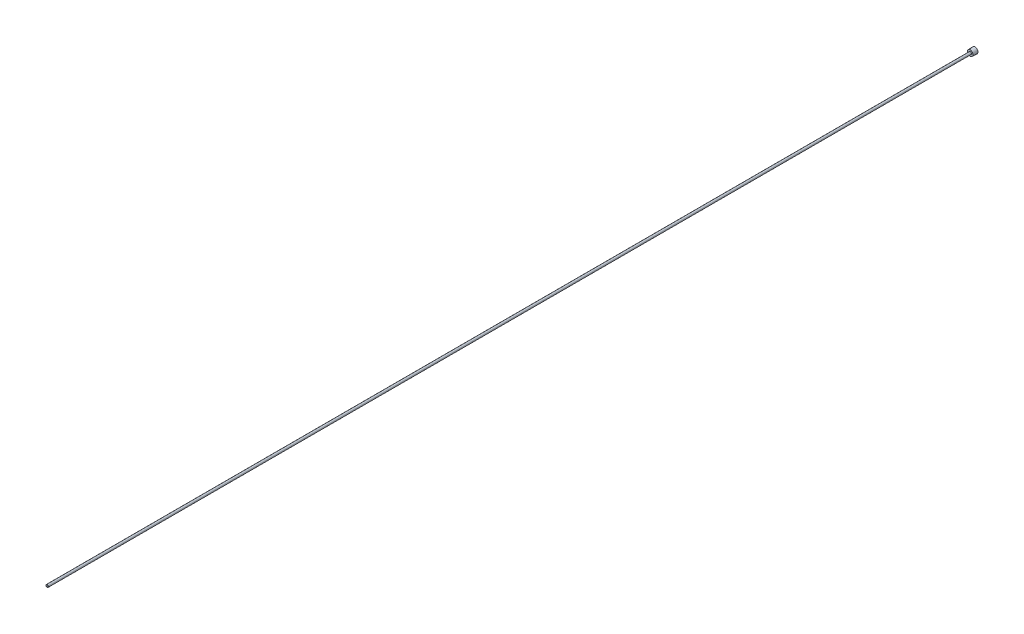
ISO-10303-21;
HEADER;
FILE_DESCRIPTION(('STEP AP214'),'2;1');
FILE_NAME('part.step','',(''),(''),'','','');
FILE_SCHEMA(('AUTOMOTIVE_DESIGN { 1 0 10303 214 1 1 1 1 }'));
ENDSEC;
DATA;
#1=APPLICATION_CONTEXT('core data for automotive mechanical design processes');
#2=APPLICATION_PROTOCOL_DEFINITION('international standard','automotive_design',2000,#1);
#3=PRODUCT_CONTEXT('',#1,'mechanical');
#4=PRODUCT('Part','Part','',(#3));
#5=PRODUCT_RELATED_PRODUCT_CATEGORY('part','',(#4));
#6=PRODUCT_DEFINITION_FORMATION('','',#4);
#7=PRODUCT_DEFINITION_CONTEXT('part definition',#1,'design');
#8=PRODUCT_DEFINITION('design','',#6,#7);
#9=PRODUCT_DEFINITION_SHAPE('','',#8);
#10=(LENGTH_UNIT() NAMED_UNIT(*) SI_UNIT(.MILLI.,.METRE.));
#11=(NAMED_UNIT(*) PLANE_ANGLE_UNIT() SI_UNIT($,.RADIAN.));
#12=(NAMED_UNIT(*) SI_UNIT($,.STERADIAN.) SOLID_ANGLE_UNIT());
#13=UNCERTAINTY_MEASURE_WITH_UNIT(LENGTH_MEASURE(1.E-05),#10,'distance_accuracy_value','');
#14=(GEOMETRIC_REPRESENTATION_CONTEXT(3) GLOBAL_UNCERTAINTY_ASSIGNED_CONTEXT((#13)) GLOBAL_UNIT_ASSIGNED_CONTEXT((#10,
#11,#12)) REPRESENTATION_CONTEXT('',''));
#15=CARTESIAN_POINT('',(0.,0.,0.));
#16=DIRECTION('',(0.,0.,1.));
#17=DIRECTION('',(1.,0.,0.));
#18=AXIS2_PLACEMENT_3D('',#15,#16,#17);
#19=CARTESIAN_POINT('',(0.,0.,0.));
#20=DIRECTION('',(0.,0.,1.));
#21=DIRECTION('',(1.,0.,0.));
#22=AXIS2_PLACEMENT_3D('',#19,#20,#21);
#23=CYLINDRICAL_SURFACE('',#22,1.3843);
#24=CARTESIAN_POINT('',(0.,0.,1219.2));
#25=DIRECTION('',(0.,0.,1.));
#26=DIRECTION('',(1.,0.,0.));
#27=AXIS2_PLACEMENT_3D('',#24,#25,#26);
#28=CIRCLE('',#27,1.3843);
#29=CARTESIAN_POINT('',(1.3843,0.,1219.2));
#30=VERTEX_POINT('',#29);
#31=EDGE_CURVE('E142',#30,#30,#28,.T.);
#32=CARTESIAN_POINT('',(0.,0.,3.96875));
#33=DIRECTION('',(0.,0.,-1.));
#34=DIRECTION('',(-1.,0.,0.));
#35=AXIS2_PLACEMENT_3D('',#32,#33,#34);
#36=CIRCLE('',#35,1.3843);
#37=CARTESIAN_POINT('',(1.3843,0.,3.96875));
#38=VERTEX_POINT('',#37);
#39=EDGE_CURVE('E37',#38,#38,#36,.F.);
#40=CARTESIAN_POINT('',(1.3843,0.,1219.2));
#41=CARTESIAN_POINT('',(1.3843,0.,1206.54134114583));
#42=CARTESIAN_POINT('',(1.3843,0.,1193.88268229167));
#43=CARTESIAN_POINT('',(1.3843,0.,1168.56536458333));
#44=CARTESIAN_POINT('',(1.3843,0.,1155.90670572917));
#45=CARTESIAN_POINT('',(1.3843,0.,1130.58938802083));
#46=CARTESIAN_POINT('',(1.3843,0.,1117.93072916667));
#47=CARTESIAN_POINT('',(1.3843,0.,1092.61341145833));
#48=CARTESIAN_POINT('',(1.3843,0.,1079.95475260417));
#49=CARTESIAN_POINT('',(1.3843,0.,1054.63743489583));
#50=CARTESIAN_POINT('',(1.3843,0.,1041.97877604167));
#51=CARTESIAN_POINT('',(1.3843,0.,1016.66145833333));
#52=CARTESIAN_POINT('',(1.3843,0.,1004.00279947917));
#53=CARTESIAN_POINT('',(1.3843,0.,978.685481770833));
#54=CARTESIAN_POINT('',(1.3843,0.,966.026822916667));
#55=CARTESIAN_POINT('',(1.3843,0.,940.709505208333));
#56=CARTESIAN_POINT('',(1.3843,0.,928.050846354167));
#57=CARTESIAN_POINT('',(1.3843,0.,902.733528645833));
#58=CARTESIAN_POINT('',(1.3843,0.,890.074869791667));
#59=CARTESIAN_POINT('',(1.3843,0.,864.757552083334));
#60=CARTESIAN_POINT('',(1.3843,0.,852.098893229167));
#61=CARTESIAN_POINT('',(1.3843,0.,826.781575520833));
#62=CARTESIAN_POINT('',(1.3843,0.,814.122916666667));
#63=CARTESIAN_POINT('',(1.3843,0.,788.805598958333));
#64=CARTESIAN_POINT('',(1.3843,0.,776.146940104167));
#65=CARTESIAN_POINT('',(1.3843,0.,750.829622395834));
#66=CARTESIAN_POINT('',(1.3843,0.,738.170963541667));
#67=CARTESIAN_POINT('',(1.3843,0.,712.853645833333));
#68=CARTESIAN_POINT('',(1.3843,0.,700.194986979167));
#69=CARTESIAN_POINT('',(1.3843,0.,674.877669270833));
#70=CARTESIAN_POINT('',(1.3843,0.,662.219010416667));
#71=CARTESIAN_POINT('',(1.3843,0.,636.901692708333));
#72=CARTESIAN_POINT('',(1.3843,0.,624.243033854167));
#73=CARTESIAN_POINT('',(1.3843,0.,598.925716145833));
#74=CARTESIAN_POINT('',(1.3843,0.,586.267057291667));
#75=CARTESIAN_POINT('',(1.3843,0.,560.949739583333));
#76=CARTESIAN_POINT('',(1.3843,0.,548.291080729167));
#77=CARTESIAN_POINT('',(1.3843,0.,522.973763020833));
#78=CARTESIAN_POINT('',(1.3843,0.,510.315104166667));
#79=CARTESIAN_POINT('',(1.3843,0.,484.997786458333));
#80=CARTESIAN_POINT('',(1.3843,0.,472.339127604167));
#81=CARTESIAN_POINT('',(1.3843,0.,447.021809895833));
#82=CARTESIAN_POINT('',(1.3843,0.,434.363151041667));
#83=CARTESIAN_POINT('',(1.3843,0.,409.045833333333));
#84=CARTESIAN_POINT('',(1.3843,0.,396.387174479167));
#85=CARTESIAN_POINT('',(1.3843,0.,371.069856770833));
#86=CARTESIAN_POINT('',(1.3843,0.,358.411197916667));
#87=CARTESIAN_POINT('',(1.3843,0.,333.093880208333));
#88=CARTESIAN_POINT('',(1.3843,0.,320.435221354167));
#89=CARTESIAN_POINT('',(1.3843,0.,295.117903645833));
#90=CARTESIAN_POINT('',(1.3843,0.,282.459244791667));
#91=CARTESIAN_POINT('',(1.3843,0.,257.141927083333));
#92=CARTESIAN_POINT('',(1.3843,0.,244.483268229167));
#93=CARTESIAN_POINT('',(1.3843,0.,219.165950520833));
#94=CARTESIAN_POINT('',(1.3843,0.,206.507291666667));
#95=CARTESIAN_POINT('',(1.3843,0.,181.189973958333));
#96=CARTESIAN_POINT('',(1.3843,0.,168.531315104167));
#97=CARTESIAN_POINT('',(1.3843,0.,143.213997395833));
#98=CARTESIAN_POINT('',(1.3843,0.,130.555338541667));
#99=CARTESIAN_POINT('',(1.3843,0.,105.238020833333));
#100=CARTESIAN_POINT('',(1.3843,0.,92.5793619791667));
#101=CARTESIAN_POINT('',(1.3843,0.,67.2620442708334));
#102=CARTESIAN_POINT('',(1.3843,0.,54.6033854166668));
#103=CARTESIAN_POINT('',(1.3843,0.,29.2860677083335));
#104=CARTESIAN_POINT('',(1.3843,0.,16.6274088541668));
#105=CARTESIAN_POINT('',(1.3843,0.,3.96875000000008));
#106=B_SPLINE_CURVE_WITH_KNOTS('',3,(#40,#41,#42,#43,#44,#45,#46,#47,#48,#49,#50,#51,#52,#53,
#54,#55,#56,#57,#58,#59,#60,#61,#62,#63,#64,#65,#66,#67,#68,#69,#70,#71,#72,#73,#74,#75,#76,#77,
#78,#79,#80,#81,#82,#83,#84,#85,#86,#87,#88,#89,#90,#91,#92,#93,#94,#95,#96,#97,#98,#99,#100,
#101,#102,#103,#104,#105),.UNSPECIFIED.,.F.,.F.,(4,2,2,2,2,2,2,2,2,2,2,2,2,2,2,2,2,2,2,2,2,2,2,
2,2,2,2,2,2,2,2,2,4),(0.,37.9759765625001,75.9519531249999,113.9279296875,151.90390625,
189.8798828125,227.855859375,265.8318359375,303.8078125,341.7837890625,379.759765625,
417.7357421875,455.71171875,493.6876953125,531.663671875,569.6396484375,607.615625,
645.5916015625,683.567578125,721.5435546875,759.51953125,797.4955078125,835.471484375,
873.4474609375,911.4234375,949.3994140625,987.375390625,1025.3513671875,1063.32734375,
1101.3033203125,1139.279296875,1177.2552734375,1215.23125),.UNSPECIFIED.);
#107=EDGE_CURVE('BSEAM33',#30,#38,#106,.T.);
#108=ORIENTED_EDGE('',*,*,#31,.T.);
#109=ORIENTED_EDGE('',*,*,#39,.F.);
#110=ORIENTED_EDGE('',*,*,#107,.T.);
#111=ORIENTED_EDGE('',*,*,#107,.F.);
#112=EDGE_LOOP('',(#108,#110,#109,#111));
#113=FACE_BOUND('',#112,.T.);
#114=ADVANCED_FACE('F33',(#113),#23,.F.);
#115=CARTESIAN_POINT('',(0.,0.,0.));
#116=DIRECTION('',(0.,0.,1.));
#117=DIRECTION('',(1.,0.,0.));
#118=AXIS2_PLACEMENT_3D('',#115,#116,#117);
#119=PLANE('',#118);
#120=DIRECTION('',(0.,1.,0.));
#121=VECTOR('',#120,1.);
#122=CARTESIAN_POINT('',(-2.38125,-1.3748153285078,0.));
#123=LINE('',#122,#121);
#124=CARTESIAN_POINT('',(-2.38125,-1.3748153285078,0.));
#125=VERTEX_POINT('',#124);
#126=CARTESIAN_POINT('',(-2.38125,1.3748153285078,0.));
#127=VERTEX_POINT('',#126);
#128=EDGE_CURVE('E124',#125,#127,#123,.T.);
#129=ORIENTED_EDGE('',*,*,#128,.F.);
#130=DIRECTION('',(-0.866025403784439,0.5,0.));
#131=VECTOR('',#130,1.);
#132=CARTESIAN_POINT('',(0.,-2.74963065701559,0.));
#133=LINE('',#132,#131);
#134=CARTESIAN_POINT('',(0.,-2.74963065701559,0.));
#135=VERTEX_POINT('',#134);
#136=EDGE_CURVE('E49',#135,#125,#133,.T.);
#137=ORIENTED_EDGE('',*,*,#136,.F.);
#138=DIRECTION('',(-0.866025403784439,-0.5,0.));
#139=VECTOR('',#138,1.);
#140=CARTESIAN_POINT('',(2.38125,-1.3748153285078,0.));
#141=LINE('',#140,#139);
#142=CARTESIAN_POINT('',(2.38125,-1.3748153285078,0.));
#143=VERTEX_POINT('',#142);
#144=EDGE_CURVE('E133',#143,#135,#141,.T.);
#145=ORIENTED_EDGE('',*,*,#144,.F.);
#146=DIRECTION('',(0.,-1.,0.));
#147=VECTOR('',#146,1.);
#148=CARTESIAN_POINT('',(2.38125,1.3748153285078,0.));
#149=LINE('',#148,#147);
#150=CARTESIAN_POINT('',(2.38125,1.3748153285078,0.));
#151=VERTEX_POINT('',#150);
#152=EDGE_CURVE('E131',#151,#143,#149,.T.);
#153=ORIENTED_EDGE('',*,*,#152,.F.);
#154=DIRECTION('',(0.866025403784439,-0.5,0.));
#155=VECTOR('',#154,1.);
#156=CARTESIAN_POINT('',(0.,2.74963065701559,0.));
#157=LINE('',#156,#155);
#158=CARTESIAN_POINT('',(0.,2.74963065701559,0.));
#159=VERTEX_POINT('',#158);
#160=EDGE_CURVE('E97',#159,#151,#157,.T.);
#161=ORIENTED_EDGE('',*,*,#160,.F.);
#162=DIRECTION('',(0.866025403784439,0.5,0.));
#163=VECTOR('',#162,1.);
#164=CARTESIAN_POINT('',(-2.38125,1.3748153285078,0.));
#165=LINE('',#164,#163);
#166=EDGE_CURVE('E127',#127,#159,#165,.T.);
#167=ORIENTED_EDGE('',*,*,#166,.F.);
#168=EDGE_LOOP('',(#129,#137,#145,#153,#161,#167));
#169=FACE_BOUND('',#168,.T.);
#170=CARTESIAN_POINT('',(0.,0.,0.));
#171=DIRECTION('',(0.,0.,1.));
#172=DIRECTION('',(1.,0.,0.));
#173=AXIS2_PLACEMENT_3D('',#170,#171,#172);
#174=CIRCLE('',#173,3.8989);
#175=CARTESIAN_POINT('',(3.8989,0.,0.));
#176=VERTEX_POINT('',#175);
#177=EDGE_CURVE('E11',#176,#176,#174,.T.);
#178=ORIENTED_EDGE('',*,*,#177,.F.);
#179=EDGE_LOOP('',(#178));
#180=FACE_BOUND('',#179,.T.);
#181=ADVANCED_FACE('F35',(#169,#180),#119,.F.);
#182=CARTESIAN_POINT('',(0.,0.,0.));
#183=DIRECTION('',(0.,0.,-1.));
#184=DIRECTION('',(-1.,0.,0.));
#185=AXIS2_PLACEMENT_3D('',#182,#183,#184);
#186=CONICAL_SURFACE('',#185,3.8989,0.0364424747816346);
#187=CARTESIAN_POINT('',(0.,0.,6.35));
#188=DIRECTION('',(0.,0.,1.));
#189=DIRECTION('',(1.,0.,0.));
#190=AXIS2_PLACEMENT_3D('',#187,#188,#189);
#191=CIRCLE('',#190,3.66738778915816);
#192=CARTESIAN_POINT('',(3.66738778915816,0.,6.35));
#193=VERTEX_POINT('',#192);
#194=EDGE_CURVE('E42',#193,#193,#191,.T.);
#195=ORIENTED_EDGE('',*,*,#194,.F.);
#196=EDGE_LOOP('',(#195));
#197=FACE_BOUND('',#196,.T.);
#198=ORIENTED_EDGE('',*,*,#177,.T.);
#199=EDGE_LOOP('',(#198));
#200=FACE_BOUND('',#199,.T.);
#201=ADVANCED_FACE('F156',(#197,#200),#186,.T.);
#202=CARTESIAN_POINT('',(0.,3.66738778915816,6.35));
#203=DIRECTION('',(0.,0.,-1.));
#204=DIRECTION('',(-1.,0.,0.));
#205=AXIS2_PLACEMENT_3D('',#202,#203,#204);
#206=PLANE('',#205);
#207=CARTESIAN_POINT('',(0.,0.,6.35));
#208=DIRECTION('',(0.,0.,1.));
#209=DIRECTION('',(1.,0.,0.));
#210=AXIS2_PLACEMENT_3D('',#207,#208,#209);
#211=CIRCLE('',#210,1.5875);
#212=CARTESIAN_POINT('',(1.5875,0.,6.35));
#213=VERTEX_POINT('',#212);
#214=EDGE_CURVE('E148',#213,#213,#211,.T.);
#215=ORIENTED_EDGE('',*,*,#214,.F.);
#216=EDGE_LOOP('',(#215));
#217=FACE_BOUND('',#216,.T.);
#218=ORIENTED_EDGE('',*,*,#194,.T.);
#219=EDGE_LOOP('',(#218));
#220=FACE_BOUND('',#219,.T.);
#221=ADVANCED_FACE('F154',(#217,#220),#206,.F.);
#222=CARTESIAN_POINT('',(0.,0.,0.));
#223=DIRECTION('',(0.,0.,1.));
#224=DIRECTION('',(1.,0.,0.));
#225=AXIS2_PLACEMENT_3D('',#222,#223,#224);
#226=CYLINDRICAL_SURFACE('',#225,1.58749999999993);
#227=CARTESIAN_POINT('',(0.,0.,1219.2));
#228=DIRECTION('',(0.,0.,1.));
#229=DIRECTION('',(1.,0.,0.));
#230=AXIS2_PLACEMENT_3D('',#227,#228,#229);
#231=CIRCLE('',#230,1.58749999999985);
#232=CARTESIAN_POINT('',(1.58749999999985,0.,1219.2));
#233=VERTEX_POINT('',#232);
#234=EDGE_CURVE('E145',#233,#233,#231,.T.);
#235=ORIENTED_EDGE('',*,*,#234,.F.);
#236=EDGE_LOOP('',(#235));
#237=FACE_BOUND('',#236,.T.);
#238=ORIENTED_EDGE('',*,*,#214,.T.);
#239=EDGE_LOOP('',(#238));
#240=FACE_BOUND('',#239,.T.);
#241=ADVANCED_FACE('F190',(#237,#240),#226,.T.);
#242=CARTESIAN_POINT('',(0.,1.58749999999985,1219.2));
#243=DIRECTION('',(0.,0.,-1.));
#244=DIRECTION('',(-1.,0.,0.));
#245=AXIS2_PLACEMENT_3D('',#242,#243,#244);
#246=PLANE('',#245);
#247=ORIENTED_EDGE('',*,*,#31,.F.);
#248=EDGE_LOOP('',(#247));
#249=FACE_BOUND('',#248,.T.);
#250=ORIENTED_EDGE('',*,*,#234,.T.);
#251=EDGE_LOOP('',(#250));
#252=FACE_BOUND('',#251,.T.);
#253=ADVANCED_FACE('F183',(#249,#252),#246,.F.);
#254=CARTESIAN_POINT('',(-2.38125,-1.3748153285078,3.96875));
#255=DIRECTION('',(0.,0.,-1.));
#256=DIRECTION('',(-1.,0.,0.));
#257=AXIS2_PLACEMENT_3D('',#254,#255,#256);
#258=PLANE('',#257);
#259=DIRECTION('',(-0.866025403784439,0.5,0.));
#260=VECTOR('',#259,1.);
#261=CARTESIAN_POINT('',(0.,-2.74963065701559,3.96875));
#262=LINE('',#261,#260);
#263=CARTESIAN_POINT('',(0.,-2.74963065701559,3.96875));
#264=VERTEX_POINT('',#263);
#265=CARTESIAN_POINT('',(-2.38125,-1.3748153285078,3.96875));
#266=VERTEX_POINT('',#265);
#267=EDGE_CURVE('E135',#264,#266,#262,.T.);
#268=ORIENTED_EDGE('',*,*,#267,.T.);
#269=DIRECTION('',(0.,1.,0.));
#270=VECTOR('',#269,1.);
#271=CARTESIAN_POINT('',(-2.38125,-1.3748153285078,3.96875));
#272=LINE('',#271,#270);
#273=CARTESIAN_POINT('',(-2.38125,1.3748153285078,3.96875));
#274=VERTEX_POINT('',#273);
#275=EDGE_CURVE('E118',#266,#274,#272,.T.);
#276=ORIENTED_EDGE('',*,*,#275,.T.);
#277=DIRECTION('',(0.866025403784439,0.5,0.));
#278=VECTOR('',#277,1.);
#279=CARTESIAN_POINT('',(-2.38125,1.3748153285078,3.96875));
#280=LINE('',#279,#278);
#281=CARTESIAN_POINT('',(0.,2.74963065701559,3.96875));
#282=VERTEX_POINT('',#281);
#283=EDGE_CURVE('E116',#274,#282,#280,.T.);
#284=ORIENTED_EDGE('',*,*,#283,.T.);
#285=DIRECTION('',(0.866025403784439,-0.5,0.));
#286=VECTOR('',#285,1.);
#287=CARTESIAN_POINT('',(0.,2.74963065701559,3.96875));
#288=LINE('',#287,#286);
#289=CARTESIAN_POINT('',(2.38125,1.3748153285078,3.96875));
#290=VERTEX_POINT('',#289);
#291=EDGE_CURVE('E94',#282,#290,#288,.T.);
#292=ORIENTED_EDGE('',*,*,#291,.T.);
#293=DIRECTION('',(0.,-1.,0.));
#294=VECTOR('',#293,1.);
#295=CARTESIAN_POINT('',(2.38125,1.3748153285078,3.96875));
#296=LINE('',#295,#294);
#297=CARTESIAN_POINT('',(2.38125,-1.3748153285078,3.96875));
#298=VERTEX_POINT('',#297);
#299=EDGE_CURVE('E105',#290,#298,#296,.T.);
#300=ORIENTED_EDGE('',*,*,#299,.T.);
#301=DIRECTION('',(-0.866025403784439,-0.5,0.));
#302=VECTOR('',#301,1.);
#303=CARTESIAN_POINT('',(2.38125,-1.3748153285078,3.96875));
#304=LINE('',#303,#302);
#305=EDGE_CURVE('E109',#298,#264,#304,.T.);
#306=ORIENTED_EDGE('',*,*,#305,.T.);
#307=EDGE_LOOP('',(#268,#276,#284,#292,#300,#306));
#308=FACE_BOUND('',#307,.T.);
#309=ORIENTED_EDGE('',*,*,#39,.T.);
#310=EDGE_LOOP('',(#309));
#311=FACE_BOUND('',#310,.T.);
#312=ADVANCED_FACE('F112',(#308,#311),#258,.T.);
#313=CARTESIAN_POINT('',(0.,-2.74963065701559,3.96875));
#314=DIRECTION('',(-0.5,-0.866025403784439,0.));
#315=DIRECTION('',(0.866025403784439,-0.5,0.));
#316=AXIS2_PLACEMENT_3D('',#313,#314,#315);
#317=PLANE('',#316);
#318=ORIENTED_EDGE('',*,*,#136,.T.);
#319=DIRECTION('',(0.,0.,-1.));
#320=VECTOR('',#319,1.);
#321=CARTESIAN_POINT('',(-2.38125,-1.3748153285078,3.96875));
#322=LINE('',#321,#320);
#323=EDGE_CURVE('E79',#266,#125,#322,.T.);
#324=ORIENTED_EDGE('',*,*,#323,.F.);
#325=ORIENTED_EDGE('',*,*,#267,.F.);
#326=DIRECTION('',(0.,0.,-1.));
#327=VECTOR('',#326,1.);
#328=CARTESIAN_POINT('',(0.,-2.74963065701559,3.96875));
#329=LINE('',#328,#327);
#330=EDGE_CURVE('E57',#264,#135,#329,.T.);
#331=ORIENTED_EDGE('',*,*,#330,.T.);
#332=EDGE_LOOP('',(#318,#324,#325,#331));
#333=FACE_BOUND('',#332,.T.);
#334=ADVANCED_FACE('F174',(#333),#317,.F.);
#335=CARTESIAN_POINT('',(2.38125,-1.3748153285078,3.96875));
#336=DIRECTION('',(0.5,-0.866025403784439,0.));
#337=DIRECTION('',(0.866025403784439,0.5,0.));
#338=AXIS2_PLACEMENT_3D('',#335,#336,#337);
#339=PLANE('',#338);
#340=ORIENTED_EDGE('',*,*,#144,.T.);
#341=ORIENTED_EDGE('',*,*,#330,.F.);
#342=ORIENTED_EDGE('',*,*,#305,.F.);
#343=DIRECTION('',(0.,0.,-1.));
#344=VECTOR('',#343,1.);
#345=CARTESIAN_POINT('',(2.38125,-1.3748153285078,3.96875));
#346=LINE('',#345,#344);
#347=EDGE_CURVE('E101',#298,#143,#346,.T.);
#348=ORIENTED_EDGE('',*,*,#347,.T.);
#349=EDGE_LOOP('',(#340,#341,#342,#348));
#350=FACE_BOUND('',#349,.T.);
#351=ADVANCED_FACE('F176',(#350),#339,.F.);
#352=CARTESIAN_POINT('',(2.38125,1.3748153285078,3.96875));
#353=DIRECTION('',(1.,0.,0.));
#354=DIRECTION('',(0.,1.,0.));
#355=AXIS2_PLACEMENT_3D('',#352,#353,#354);
#356=PLANE('',#355);
#357=ORIENTED_EDGE('',*,*,#152,.T.);
#358=ORIENTED_EDGE('',*,*,#347,.F.);
#359=ORIENTED_EDGE('',*,*,#299,.F.);
#360=DIRECTION('',(0.,0.,-1.));
#361=VECTOR('',#360,1.);
#362=CARTESIAN_POINT('',(2.38125,1.3748153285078,3.96875));
#363=LINE('',#362,#361);
#364=EDGE_CURVE('E90',#290,#151,#363,.T.);
#365=ORIENTED_EDGE('',*,*,#364,.T.);
#366=EDGE_LOOP('',(#357,#358,#359,#365));
#367=FACE_BOUND('',#366,.T.);
#368=ADVANCED_FACE('F106',(#367),#356,.F.);
#369=CARTESIAN_POINT('',(0.,2.74963065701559,3.96875));
#370=DIRECTION('',(0.5,0.866025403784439,0.));
#371=DIRECTION('',(-0.866025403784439,0.5,0.));
#372=AXIS2_PLACEMENT_3D('',#369,#370,#371);
#373=PLANE('',#372);
#374=ORIENTED_EDGE('',*,*,#160,.T.);
#375=ORIENTED_EDGE('',*,*,#364,.F.);
#376=ORIENTED_EDGE('',*,*,#291,.F.);
#377=DIRECTION('',(0.,0.,-1.));
#378=VECTOR('',#377,1.);
#379=CARTESIAN_POINT('',(0.,2.74963065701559,3.96875));
#380=LINE('',#379,#378);
#381=EDGE_CURVE('E102',#282,#159,#380,.T.);
#382=ORIENTED_EDGE('',*,*,#381,.T.);
#383=EDGE_LOOP('',(#374,#375,#376,#382));
#384=FACE_BOUND('',#383,.T.);
#385=ADVANCED_FACE('F92',(#384),#373,.F.);
#386=CARTESIAN_POINT('',(-2.38125,1.3748153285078,3.96875));
#387=DIRECTION('',(-0.5,0.866025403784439,0.));
#388=DIRECTION('',(-0.866025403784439,-0.5,0.));
#389=AXIS2_PLACEMENT_3D('',#386,#387,#388);
#390=PLANE('',#389);
#391=ORIENTED_EDGE('',*,*,#166,.T.);
#392=ORIENTED_EDGE('',*,*,#381,.F.);
#393=ORIENTED_EDGE('',*,*,#283,.F.);
#394=DIRECTION('',(0.,0.,-1.));
#395=VECTOR('',#394,1.);
#396=CARTESIAN_POINT('',(-2.38125,1.3748153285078,3.96875));
#397=LINE('',#396,#395);
#398=EDGE_CURVE('E139',#274,#127,#397,.T.);
#399=ORIENTED_EDGE('',*,*,#398,.T.);
#400=EDGE_LOOP('',(#391,#392,#393,#399));
#401=FACE_BOUND('',#400,.T.);
#402=ADVANCED_FACE('F246',(#401),#390,.F.);
#403=CARTESIAN_POINT('',(-2.38125,-1.3748153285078,3.96875));
#404=DIRECTION('',(-1.,0.,0.));
#405=DIRECTION('',(0.,-1.,0.));
#406=AXIS2_PLACEMENT_3D('',#403,#404,#405);
#407=PLANE('',#406);
#408=ORIENTED_EDGE('',*,*,#128,.T.);
#409=ORIENTED_EDGE('',*,*,#398,.F.);
#410=ORIENTED_EDGE('',*,*,#275,.F.);
#411=ORIENTED_EDGE('',*,*,#323,.T.);
#412=EDGE_LOOP('',(#408,#409,#410,#411));
#413=FACE_BOUND('',#412,.T.);
#414=ADVANCED_FACE('F172',(#413),#407,.F.);
#415=CLOSED_SHELL('',(#114,#181,#201,#221,#241,#253,#312,#334,#351,#368,#385,#402,#414));
#416=MANIFOLD_SOLID_BREP('B2',#415);
#417=ADVANCED_BREP_SHAPE_REPRESENTATION('',(#18,#416),#14);
#418=SHAPE_DEFINITION_REPRESENTATION(#9,#417);
ENDSEC;
END-ISO-10303-21;
